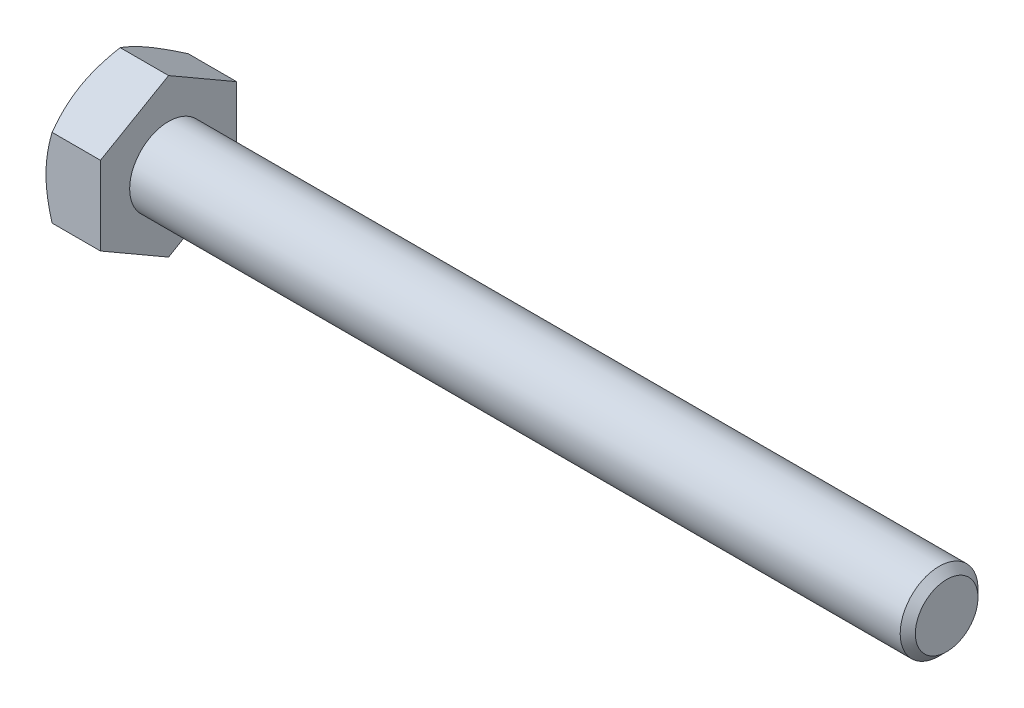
from build123d import *

# Parameters (mm, degrees)
BASEHEAD_DEPTH = 2.8


with BuildPart() as part:
    # Sketch1 → BaseHead (new body)
    with BuildSketch(Plane(origin=(0, 0, 0), x_dir=(0, 0, -1), z_dir=(1, 0, 0))):
        Polygon((3.5, 2.020725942), (3.5, -2.020725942), (0, -4.041451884), (-3.5, -2.020725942), (-3.5, 2.020725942), (0, 4.041451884), align=None)
    extrude(amount=BASEHEAD_DEPTH)

    # BodySke → BaseBody (revolve)
    with BuildSketch(Plane.XY, mode=Mode.PRIVATE) as basebody_sk:
        Polygon((0, 0), (42.8, 0), (42.8, 1.61), (42.41, 2), (0, 2), align=None)
    revolve(basebody_sk.sketch.rotate(Axis((0, 0, 0), (1, 0, 0)), 90), axis=Axis((0, 0, 0), (1, 0, 0)))

    # Sketch3 → HeadChamfer (revolve, cut)
    with BuildSketch(Plane.XY):
        Polygon((0, 3.5), (3.199358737, 9.041451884), (3.199358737, 14.041451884), (-10, 14.041451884), (-10, 3.5), align=None)
    revolve(axis=Axis((0, 0, 0), (1, 0, 0)), mode=Mode.SUBTRACT)


solid = part.part
